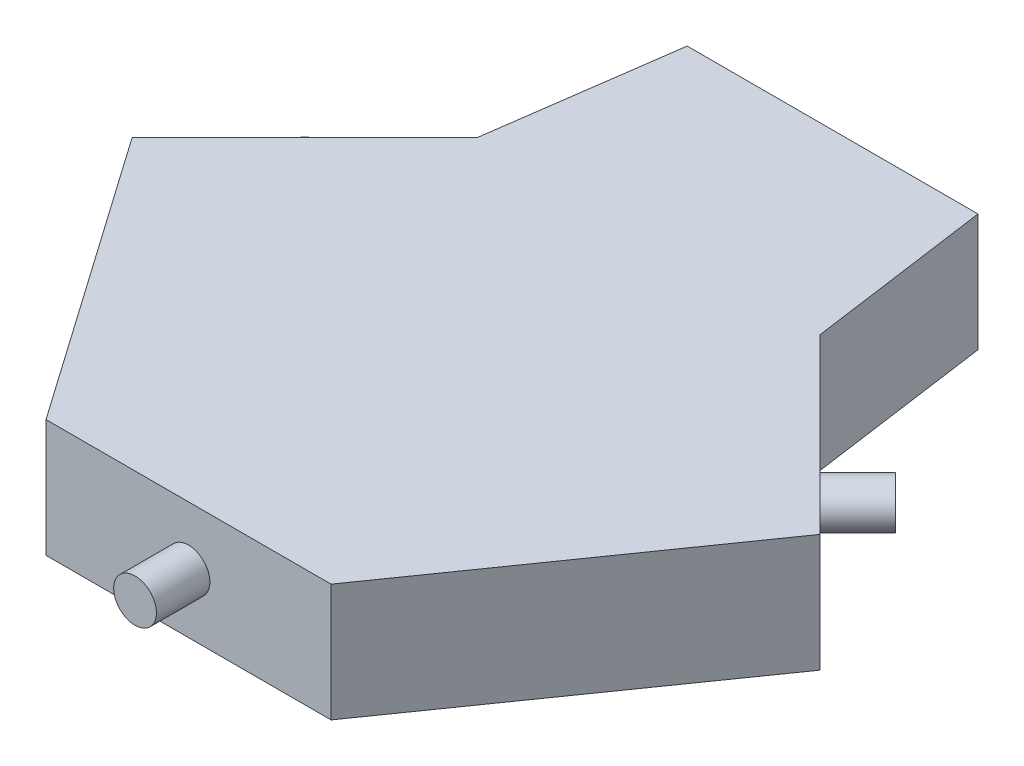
from build123d import *

# Parameters (mm, degrees)
BOSS_EXTRUDE1_DEPTH = 55
SKETCH4_R           = 10
BOSS_EXTRUDE2_DEPTH = 25
SKETCH3_R           = 10
BOSS_EXTRUDE3_DEPTH = 25
SKETCH2_R           = 10
BOSS_EXTRUDE4_DEPTH = 25


with BuildPart() as part:
    # Sketch1 → Boss-Extrude1 (new body)
    with BuildSketch(Plane(origin=(0, 0, 0), x_dir=(1, 0, 0), z_dir=(0, 1, 0))):
        Polygon((-66.653329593, -301.206522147), (-160.779878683, -166.779878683), (-80, -86), (80, -86), (160.779878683, -166.779878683), (66.653329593, -301.206522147), align=None)
        Polygon((-68, 0), (68, 0), (80, -86), (-80, -86), align=None)
    extrude(amount=BOSS_EXTRUDE1_DEPTH)

    # Sketch4 → Boss-Extrude2 (add)
    with BuildSketch(Plane.XY.offset(301.206522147)):
        with Locations(Location((0, 27.5, 0), (0, 0, 180))):
            Circle(SKETCH4_R)
    extrude(amount=BOSS_EXTRUDE2_DEPTH)

    # Sketch3 → Boss-Extrude3 (add)
    with BuildSketch(Plane(origin=(3, 0, 3), x_dir=(-0.7071067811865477, 0, 0.7071067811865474), z_dir=(-0.7071067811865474, 0, -0.7071067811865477))):
        with Locations(Location((174.499725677, 27.5, 0), (0, 0, 180))):
            Circle(SKETCH3_R)
    extrude(amount=BOSS_EXTRUDE3_DEPTH)

    # Sketch2 → Boss-Extrude4 (add)
    with BuildSketch(Plane(origin=(-3, 0, 3), x_dir=(-0.7071067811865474, 0, -0.7071067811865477), z_dir=(0.7071067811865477, 0, -0.7071067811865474))):
        with Locations((-174.499725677, 27.5)):
            Circle(SKETCH2_R)
    extrude(amount=BOSS_EXTRUDE4_DEPTH)


solid = part.part
